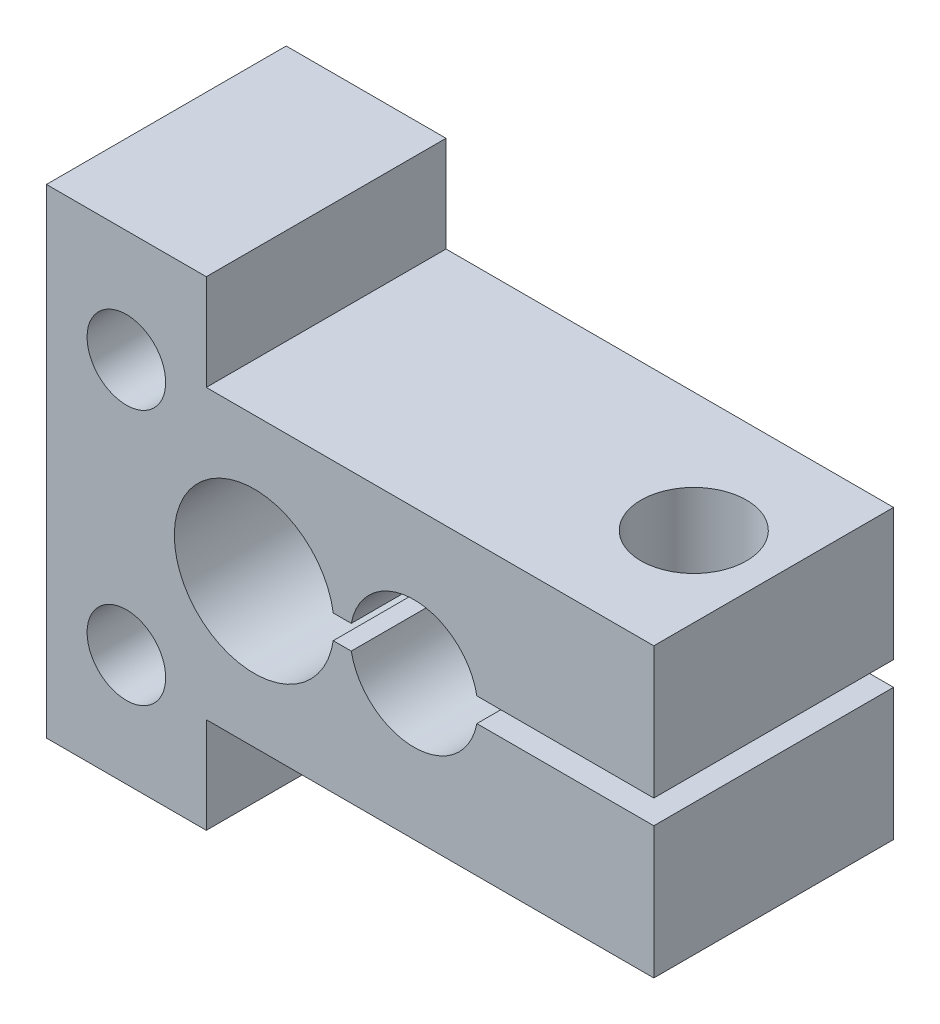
ISO-10303-21;
HEADER;
FILE_DESCRIPTION(('STEP AP214'),'2;1');
FILE_NAME('part.step','',(''),(''),'','','');
FILE_SCHEMA(('AUTOMOTIVE_DESIGN { 1 0 10303 214 1 1 1 1 }'));
ENDSEC;
DATA;
#1=APPLICATION_CONTEXT('core data for automotive mechanical design processes');
#2=APPLICATION_PROTOCOL_DEFINITION('international standard','automotive_design',2000,#1);
#3=PRODUCT_CONTEXT('',#1,'mechanical');
#4=PRODUCT('Part','Part','',(#3));
#5=PRODUCT_RELATED_PRODUCT_CATEGORY('part','',(#4));
#6=PRODUCT_DEFINITION_FORMATION('','',#4);
#7=PRODUCT_DEFINITION_CONTEXT('part definition',#1,'design');
#8=PRODUCT_DEFINITION('design','',#6,#7);
#9=PRODUCT_DEFINITION_SHAPE('','',#8);
#10=(LENGTH_UNIT() NAMED_UNIT(*) SI_UNIT(.MILLI.,.METRE.));
#11=(NAMED_UNIT(*) PLANE_ANGLE_UNIT() SI_UNIT($,.RADIAN.));
#12=(NAMED_UNIT(*) SI_UNIT($,.STERADIAN.) SOLID_ANGLE_UNIT());
#13=UNCERTAINTY_MEASURE_WITH_UNIT(LENGTH_MEASURE(1.E-05),#10,'distance_accuracy_value','');
#14=(GEOMETRIC_REPRESENTATION_CONTEXT(3) GLOBAL_UNCERTAINTY_ASSIGNED_CONTEXT((#13)) GLOBAL_UNIT_ASSIGNED_CONTEXT((#10,
#11,#12)) REPRESENTATION_CONTEXT('',''));
#15=CARTESIAN_POINT('',(0.,0.,0.));
#16=DIRECTION('',(0.,0.,1.));
#17=DIRECTION('',(1.,0.,0.));
#18=AXIS2_PLACEMENT_3D('',#15,#16,#17);
#19=CARTESIAN_POINT('',(-3.,-9.,7.5));
#20=DIRECTION('',(0.,1.,0.));
#21=DIRECTION('',(0.,0.,1.));
#22=AXIS2_PLACEMENT_3D('',#19,#20,#21);
#23=PLANE('',#22);
#24=DIRECTION('',(0.,0.,-1.));
#25=VECTOR('',#24,1.);
#26=CARTESIAN_POINT('',(-3.,-9.,7.5));
#27=LINE('',#26,#25);
#28=CARTESIAN_POINT('',(-3.,-9.,7.5));
#29=VERTEX_POINT('',#28);
#30=CARTESIAN_POINT('',(-3.,-9.,-7.5));
#31=VERTEX_POINT('',#30);
#32=EDGE_CURVE('E244',#29,#31,#27,.T.);
#33=ORIENTED_EDGE('',*,*,#32,.T.);
#34=DIRECTION('',(1.,0.,0.));
#35=VECTOR('',#34,1.);
#36=CARTESIAN_POINT('',(-3.,-9.,-7.5));
#37=LINE('',#36,#35);
#38=CARTESIAN_POINT('',(25.,-9.,-7.5));
#39=VERTEX_POINT('',#38);
#40=EDGE_CURVE('E206',#31,#39,#37,.T.);
#41=ORIENTED_EDGE('',*,*,#40,.T.);
#42=DIRECTION('',(0.,0.,-1.));
#43=VECTOR('',#42,1.);
#44=CARTESIAN_POINT('',(25.,-9.,7.5));
#45=LINE('',#44,#43);
#46=CARTESIAN_POINT('',(25.,-9.,7.5));
#47=VERTEX_POINT('',#46);
#48=EDGE_CURVE('E242',#47,#39,#45,.T.);
#49=ORIENTED_EDGE('',*,*,#48,.F.);
#50=DIRECTION('',(1.,0.,0.));
#51=VECTOR('',#50,1.);
#52=CARTESIAN_POINT('',(-3.,-9.,7.5));
#53=LINE('',#52,#51);
#54=EDGE_CURVE('E227',#29,#47,#53,.T.);
#55=ORIENTED_EDGE('',*,*,#54,.F.);
#56=EDGE_LOOP('',(#33,#41,#49,#55));
#57=FACE_BOUND('',#56,.T.);
#58=CARTESIAN_POINT('',(20.,-9.,0.));
#59=DIRECTION('',(0.,1.,0.));
#60=DIRECTION('',(0.,0.,1.));
#61=AXIS2_PLACEMENT_3D('',#58,#59,#60);
#62=CIRCLE('',#61,3.);
#63=CARTESIAN_POINT('',(20.,-9.,3.));
#64=VERTEX_POINT('',#63);
#65=EDGE_CURVE('E275',#64,#64,#62,.T.);
#66=ORIENTED_EDGE('',*,*,#65,.T.);
#67=EDGE_LOOP('',(#66));
#68=FACE_BOUND('',#67,.T.);
#69=ADVANCED_FACE('F35',(#57,#68),#23,.F.);
#70=CARTESIAN_POINT('',(25.,9.,7.5));
#71=DIRECTION('',(0.,-1.,0.));
#72=DIRECTION('',(0.,0.,-1.));
#73=AXIS2_PLACEMENT_3D('',#70,#71,#72);
#74=PLANE('',#73);
#75=DIRECTION('',(0.,0.,-1.));
#76=VECTOR('',#75,1.);
#77=CARTESIAN_POINT('',(25.,9.,7.5));
#78=LINE('',#77,#76);
#79=CARTESIAN_POINT('',(25.,9.,7.5));
#80=VERTEX_POINT('',#79);
#81=CARTESIAN_POINT('',(25.,9.,-7.5));
#82=VERTEX_POINT('',#81);
#83=EDGE_CURVE('E239',#80,#82,#78,.T.);
#84=ORIENTED_EDGE('',*,*,#83,.T.);
#85=DIRECTION('',(-1.,0.,0.));
#86=VECTOR('',#85,1.);
#87=CARTESIAN_POINT('',(25.,9.,-7.5));
#88=LINE('',#87,#86);
#89=CARTESIAN_POINT('',(-3.,9.,-7.5));
#90=VERTEX_POINT('',#89);
#91=EDGE_CURVE('E213',#82,#90,#88,.T.);
#92=ORIENTED_EDGE('',*,*,#91,.T.);
#93=DIRECTION('',(0.,0.,-1.));
#94=VECTOR('',#93,1.);
#95=CARTESIAN_POINT('',(-3.,9.,7.5));
#96=LINE('',#95,#94);
#97=CARTESIAN_POINT('',(-3.,9.,7.5));
#98=VERTEX_POINT('',#97);
#99=EDGE_CURVE('E237',#98,#90,#96,.T.);
#100=ORIENTED_EDGE('',*,*,#99,.F.);
#101=DIRECTION('',(-1.,0.,0.));
#102=VECTOR('',#101,1.);
#103=CARTESIAN_POINT('',(25.,9.,7.5));
#104=LINE('',#103,#102);
#105=EDGE_CURVE('E232',#80,#98,#104,.T.);
#106=ORIENTED_EDGE('',*,*,#105,.F.);
#107=EDGE_LOOP('',(#84,#92,#100,#106));
#108=FACE_BOUND('',#107,.T.);
#109=CARTESIAN_POINT('',(20.,9.,0.));
#110=DIRECTION('',(0.,1.,0.));
#111=DIRECTION('',(0.,0.,1.));
#112=AXIS2_PLACEMENT_3D('',#109,#110,#111);
#113=CIRCLE('',#112,3.3);
#114=CARTESIAN_POINT('',(20.,9.,3.3));
#115=VERTEX_POINT('',#114);
#116=EDGE_CURVE('E263',#115,#115,#113,.T.);
#117=ORIENTED_EDGE('',*,*,#116,.F.);
#118=EDGE_LOOP('',(#117));
#119=FACE_BOUND('',#118,.T.);
#120=ADVANCED_FACE('F349',(#108,#119),#74,.F.);
#121=CARTESIAN_POINT('',(13.929058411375,-0.75,8.5));
#122=DIRECTION('',(0.,1.,0.));
#123=DIRECTION('',(0.,0.,1.));
#124=AXIS2_PLACEMENT_3D('',#121,#122,#123);
#125=PLANE('',#124);
#126=DIRECTION('',(0.,0.,-1.));
#127=VECTOR('',#126,1.);
#128=CARTESIAN_POINT('',(25.,-0.750000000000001,7.5));
#129=LINE('',#128,#127);
#130=CARTESIAN_POINT('',(25.,-0.750000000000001,7.5));
#131=VERTEX_POINT('',#130);
#132=CARTESIAN_POINT('',(25.,-0.750000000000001,-7.5));
#133=VERTEX_POINT('',#132);
#134=EDGE_CURVE('E183',#131,#133,#129,.T.);
#135=ORIENTED_EDGE('',*,*,#134,.T.);
#136=DIRECTION('',(-1.,0.,0.));
#137=VECTOR('',#136,1.);
#138=CARTESIAN_POINT('',(-13.,-0.750000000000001,-7.5));
#139=LINE('',#138,#137);
#140=CARTESIAN_POINT('',(13.929058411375,-0.75,-7.5));
#141=VERTEX_POINT('',#140);
#142=EDGE_CURVE('E12',#133,#141,#139,.T.);
#143=ORIENTED_EDGE('',*,*,#142,.T.);
#144=DIRECTION('',(0.,0.,-1.));
#145=VECTOR('',#144,1.);
#146=CARTESIAN_POINT('',(13.929058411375,-0.75,8.5));
#147=LINE('',#146,#145);
#148=CARTESIAN_POINT('',(13.929058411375,-0.75,7.5));
#149=VERTEX_POINT('',#148);
#150=EDGE_CURVE('E292',#149,#141,#147,.T.);
#151=ORIENTED_EDGE('',*,*,#150,.F.);
#152=DIRECTION('',(-1.,0.,0.));
#153=VECTOR('',#152,1.);
#154=CARTESIAN_POINT('',(-13.,-0.750000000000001,7.5));
#155=LINE('',#154,#153);
#156=EDGE_CURVE('E185',#131,#149,#155,.T.);
#157=ORIENTED_EDGE('',*,*,#156,.F.);
#158=EDGE_LOOP('',(#135,#143,#151,#157));
#159=FACE_BOUND('',#158,.T.);
#160=CARTESIAN_POINT('',(20.,-0.750000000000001,0.));
#161=DIRECTION('',(0.,1.,0.));
#162=DIRECTION('',(0.,0.,1.));
#163=AXIS2_PLACEMENT_3D('',#160,#161,#162);
#164=CIRCLE('',#163,2.4585);
#165=CARTESIAN_POINT('',(20.,-0.750000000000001,2.4585));
#166=VERTEX_POINT('',#165);
#167=EDGE_CURVE('E39',#166,#166,#164,.F.);
#168=ORIENTED_EDGE('',*,*,#167,.T.);
#169=EDGE_LOOP('',(#168));
#170=FACE_BOUND('',#169,.T.);
#171=ADVANCED_FACE('F312',(#159,#170),#125,.T.);
#172=CARTESIAN_POINT('',(26.,0.75000000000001,8.5));
#173=DIRECTION('',(0.,-1.,0.));
#174=DIRECTION('',(1.,0.,0.));
#175=AXIS2_PLACEMENT_3D('',#172,#173,#174);
#176=PLANE('',#175);
#177=DIRECTION('',(0.,0.,-1.));
#178=VECTOR('',#177,1.);
#179=CARTESIAN_POINT('',(13.929058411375,0.75,8.5));
#180=LINE('',#179,#178);
#181=CARTESIAN_POINT('',(13.929058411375,0.75,7.5));
#182=VERTEX_POINT('',#181);
#183=CARTESIAN_POINT('',(13.929058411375,0.75,-7.5));
#184=VERTEX_POINT('',#183);
#185=EDGE_CURVE('E157',#182,#184,#180,.T.);
#186=ORIENTED_EDGE('',*,*,#185,.T.);
#187=DIRECTION('',(1.,0.,0.));
#188=VECTOR('',#187,1.);
#189=CARTESIAN_POINT('',(-13.,0.749999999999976,-7.5));
#190=LINE('',#189,#188);
#191=CARTESIAN_POINT('',(25.,0.750000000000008,-7.5));
#192=VERTEX_POINT('',#191);
#193=EDGE_CURVE('E255',#184,#192,#190,.T.);
#194=ORIENTED_EDGE('',*,*,#193,.T.);
#195=DIRECTION('',(0.,0.,1.));
#196=VECTOR('',#195,1.);
#197=CARTESIAN_POINT('',(25.,0.750000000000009,7.5));
#198=LINE('',#197,#196);
#199=CARTESIAN_POINT('',(25.,0.750000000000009,7.5));
#200=VERTEX_POINT('',#199);
#201=EDGE_CURVE('E160',#192,#200,#198,.T.);
#202=ORIENTED_EDGE('',*,*,#201,.T.);
#203=DIRECTION('',(1.,0.,0.));
#204=VECTOR('',#203,1.);
#205=CARTESIAN_POINT('',(-13.,0.749999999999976,7.5));
#206=LINE('',#205,#204);
#207=EDGE_CURVE('E181',#182,#200,#206,.T.);
#208=ORIENTED_EDGE('',*,*,#207,.F.);
#209=EDGE_LOOP('',(#186,#194,#202,#208));
#210=FACE_BOUND('',#209,.T.);
#211=CARTESIAN_POINT('',(20.,0.750000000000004,0.));
#212=DIRECTION('',(0.,-1.,0.));
#213=DIRECTION('',(1.,0.,0.));
#214=AXIS2_PLACEMENT_3D('',#211,#212,#213);
#215=CIRCLE('',#214,3.3);
#216=CARTESIAN_POINT('',(23.3,0.750000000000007,0.));
#217=VERTEX_POINT('',#216);
#218=EDGE_CURVE('E261',#217,#217,#215,.F.);
#219=ORIENTED_EDGE('',*,*,#218,.T.);
#220=EDGE_LOOP('',(#219));
#221=FACE_BOUND('',#220,.T.);
#222=ADVANCED_FACE('F359',(#210,#221),#176,.T.);
#223=CARTESIAN_POINT('',(-13.,15.,7.5));
#224=DIRECTION('',(0.,0.,1.));
#225=DIRECTION('',(1.,0.,0.));
#226=AXIS2_PLACEMENT_3D('',#223,#224,#225);
#227=PLANE('',#226);
#228=CARTESIAN_POINT('',(-8.,8.,7.5));
#229=DIRECTION('',(0.,0.,-1.));
#230=DIRECTION('',(-1.,0.,0.));
#231=AXIS2_PLACEMENT_3D('',#228,#229,#230);
#232=CIRCLE('',#231,2.4585);
#233=CARTESIAN_POINT('',(-10.4585,8.,7.5));
#234=VERTEX_POINT('',#233);
#235=EDGE_CURVE('E284',#234,#234,#232,.T.);
#236=ORIENTED_EDGE('',*,*,#235,.T.);
#237=EDGE_LOOP('',(#236));
#238=FACE_BOUND('',#237,.T.);
#239=DIRECTION('',(0.,1.,0.));
#240=VECTOR('',#239,1.);
#241=CARTESIAN_POINT('',(25.,-9.,7.5));
#242=LINE('',#241,#240);
#243=EDGE_CURVE('E230',#47,#131,#242,.T.);
#244=ORIENTED_EDGE('',*,*,#243,.T.);
#245=ORIENTED_EDGE('',*,*,#156,.T.);
#246=CARTESIAN_POINT('',(9.9999999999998,-2.74411569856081E-13,7.5));
#247=DIRECTION('',(0.,0.,1.));
#248=DIRECTION('',(1.,0.,0.));
#249=AXIS2_PLACEMENT_3D('',#246,#247,#248);
#250=CIRCLE('',#249,3.99999999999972);
#251=CARTESIAN_POINT('',(6.0709415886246,-0.749999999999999,7.5));
#252=VERTEX_POINT('',#251);
#253=EDGE_CURVE('E188',#149,#252,#250,.F.);
#254=ORIENTED_EDGE('',*,*,#253,.T.);
#255=DIRECTION('',(-1.,0.,0.));
#256=VECTOR('',#255,1.);
#257=CARTESIAN_POINT('',(-13.,-0.750000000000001,7.5));
#258=LINE('',#257,#256);
#259=CARTESIAN_POINT('',(4.9434299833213,-0.75,7.5));
#260=VERTEX_POINT('',#259);
#261=EDGE_CURVE('E191',#252,#260,#258,.T.);
#262=ORIENTED_EDGE('',*,*,#261,.T.);
#263=CARTESIAN_POINT('',(0.,0.,7.5));
#264=DIRECTION('',(0.,0.,1.));
#265=DIRECTION('',(1.,0.,0.));
#266=AXIS2_PLACEMENT_3D('',#263,#264,#265);
#267=CIRCLE('',#266,5.);
#268=CARTESIAN_POINT('',(4.9434299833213,0.75,7.5));
#269=VERTEX_POINT('',#268);
#270=EDGE_CURVE('E172',#260,#269,#267,.F.);
#271=ORIENTED_EDGE('',*,*,#270,.T.);
#272=DIRECTION('',(1.,0.,0.));
#273=VECTOR('',#272,1.);
#274=CARTESIAN_POINT('',(-13.,0.750000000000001,7.5));
#275=LINE('',#274,#273);
#276=CARTESIAN_POINT('',(6.0709415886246,0.75,7.5));
#277=VERTEX_POINT('',#276);
#278=EDGE_CURVE('E161',#269,#277,#275,.T.);
#279=ORIENTED_EDGE('',*,*,#278,.T.);
#280=CARTESIAN_POINT('',(9.9999999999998,-2.74411569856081E-13,7.5));
#281=DIRECTION('',(0.,0.,1.));
#282=DIRECTION('',(1.,0.,0.));
#283=AXIS2_PLACEMENT_3D('',#280,#281,#282);
#284=CIRCLE('',#283,3.99999999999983);
#285=EDGE_CURVE('E151',#277,#182,#284,.F.);
#286=ORIENTED_EDGE('',*,*,#285,.T.);
#287=ORIENTED_EDGE('',*,*,#207,.T.);
#288=EDGE_CURVE('E229',#200,#80,#242,.T.);
#289=ORIENTED_EDGE('',*,*,#288,.T.);
#290=ORIENTED_EDGE('',*,*,#105,.T.);
#291=DIRECTION('',(0.,1.,0.));
#292=VECTOR('',#291,1.);
#293=CARTESIAN_POINT('',(-3.,9.,7.5));
#294=LINE('',#293,#292);
#295=CARTESIAN_POINT('',(-3.,15.,7.5));
#296=VERTEX_POINT('',#295);
#297=EDGE_CURVE('E60',#98,#296,#294,.T.);
#298=ORIENTED_EDGE('',*,*,#297,.T.);
#299=DIRECTION('',(-1.,0.,0.));
#300=VECTOR('',#299,1.);
#301=CARTESIAN_POINT('',(-3.,15.,7.5));
#302=LINE('',#301,#300);
#303=CARTESIAN_POINT('',(-13.,15.,7.5));
#304=VERTEX_POINT('',#303);
#305=EDGE_CURVE('E219',#296,#304,#302,.T.);
#306=ORIENTED_EDGE('',*,*,#305,.T.);
#307=DIRECTION('',(0.,-1.,0.));
#308=VECTOR('',#307,1.);
#309=CARTESIAN_POINT('',(-13.,15.,7.5));
#310=LINE('',#309,#308);
#311=CARTESIAN_POINT('',(-13.,-15.,7.5));
#312=VERTEX_POINT('',#311);
#313=EDGE_CURVE('E221',#304,#312,#310,.T.);
#314=ORIENTED_EDGE('',*,*,#313,.T.);
#315=DIRECTION('',(1.,0.,0.));
#316=VECTOR('',#315,1.);
#317=CARTESIAN_POINT('',(-13.,-15.,7.5));
#318=LINE('',#317,#316);
#319=CARTESIAN_POINT('',(-3.,-15.,7.5));
#320=VERTEX_POINT('',#319);
#321=EDGE_CURVE('E223',#312,#320,#318,.T.);
#322=ORIENTED_EDGE('',*,*,#321,.T.);
#323=DIRECTION('',(0.,1.,0.));
#324=VECTOR('',#323,1.);
#325=CARTESIAN_POINT('',(-3.,-15.,7.5));
#326=LINE('',#325,#324);
#327=EDGE_CURVE('E225',#320,#29,#326,.T.);
#328=ORIENTED_EDGE('',*,*,#327,.T.);
#329=ORIENTED_EDGE('',*,*,#54,.T.);
#330=EDGE_LOOP('',(#244,#245,#254,#262,#271,#279,#286,#287,#289,#290,#298,#306,#314,#322,#328,#329));
#331=FACE_BOUND('',#330,.T.);
#332=CARTESIAN_POINT('',(-8.,-8.,7.5));
#333=DIRECTION('',(0.,0.,-1.));
#334=DIRECTION('',(-1.,0.,0.));
#335=AXIS2_PLACEMENT_3D('',#332,#333,#334);
#336=CIRCLE('',#335,2.4585);
#337=CARTESIAN_POINT('',(-10.4585,-8.,7.5));
#338=VERTEX_POINT('',#337);
#339=EDGE_CURVE('E267',#338,#338,#336,.T.);
#340=ORIENTED_EDGE('',*,*,#339,.T.);
#341=EDGE_LOOP('',(#340));
#342=FACE_BOUND('',#341,.T.);
#343=ADVANCED_FACE('F169',(#238,#331,#342),#227,.T.);
#344=CARTESIAN_POINT('',(-13.,15.,-7.5));
#345=DIRECTION('',(0.,0.,1.));
#346=DIRECTION('',(1.,0.,0.));
#347=AXIS2_PLACEMENT_3D('',#344,#345,#346);
#348=PLANE('',#347);
#349=CARTESIAN_POINT('',(-8.,8.,-7.5));
#350=DIRECTION('',(0.,0.,-1.));
#351=DIRECTION('',(-1.,0.,0.));
#352=AXIS2_PLACEMENT_3D('',#349,#350,#351);
#353=CIRCLE('',#352,2.4585);
#354=CARTESIAN_POINT('',(-10.4585,8.,-7.5));
#355=VERTEX_POINT('',#354);
#356=EDGE_CURVE('E287',#355,#355,#353,.T.);
#357=ORIENTED_EDGE('',*,*,#356,.F.);
#358=EDGE_LOOP('',(#357));
#359=FACE_BOUND('',#358,.T.);
#360=ORIENTED_EDGE('',*,*,#142,.F.);
#361=DIRECTION('',(0.,1.,0.));
#362=VECTOR('',#361,1.);
#363=CARTESIAN_POINT('',(25.,-9.,-7.5));
#364=LINE('',#363,#362);
#365=EDGE_CURVE('E210',#39,#133,#364,.T.);
#366=ORIENTED_EDGE('',*,*,#365,.F.);
#367=ORIENTED_EDGE('',*,*,#40,.F.);
#368=DIRECTION('',(0.,1.,0.));
#369=VECTOR('',#368,1.);
#370=CARTESIAN_POINT('',(-3.,-15.,-7.5));
#371=LINE('',#370,#369);
#372=CARTESIAN_POINT('',(-3.,-15.,-7.5));
#373=VERTEX_POINT('',#372);
#374=EDGE_CURVE('E203',#373,#31,#371,.T.);
#375=ORIENTED_EDGE('',*,*,#374,.F.);
#376=DIRECTION('',(1.,0.,0.));
#377=VECTOR('',#376,1.);
#378=CARTESIAN_POINT('',(-13.,-15.,-7.5));
#379=LINE('',#378,#377);
#380=CARTESIAN_POINT('',(-13.,-15.,-7.5));
#381=VERTEX_POINT('',#380);
#382=EDGE_CURVE('E200',#381,#373,#379,.T.);
#383=ORIENTED_EDGE('',*,*,#382,.F.);
#384=DIRECTION('',(0.,-1.,0.));
#385=VECTOR('',#384,1.);
#386=CARTESIAN_POINT('',(-13.,15.,-7.5));
#387=LINE('',#386,#385);
#388=CARTESIAN_POINT('',(-13.,15.,-7.5));
#389=VERTEX_POINT('',#388);
#390=EDGE_CURVE('E197',#389,#381,#387,.T.);
#391=ORIENTED_EDGE('',*,*,#390,.F.);
#392=DIRECTION('',(-1.,0.,0.));
#393=VECTOR('',#392,1.);
#394=CARTESIAN_POINT('',(-3.,15.,-7.5));
#395=LINE('',#394,#393);
#396=CARTESIAN_POINT('',(-3.,15.,-7.5));
#397=VERTEX_POINT('',#396);
#398=EDGE_CURVE('E194',#397,#389,#395,.T.);
#399=ORIENTED_EDGE('',*,*,#398,.F.);
#400=DIRECTION('',(0.,1.,0.));
#401=VECTOR('',#400,1.);
#402=CARTESIAN_POINT('',(-3.,9.,-7.5));
#403=LINE('',#402,#401);
#404=EDGE_CURVE('E216',#90,#397,#403,.T.);
#405=ORIENTED_EDGE('',*,*,#404,.F.);
#406=ORIENTED_EDGE('',*,*,#91,.F.);
#407=EDGE_CURVE('E209',#192,#82,#364,.T.);
#408=ORIENTED_EDGE('',*,*,#407,.F.);
#409=ORIENTED_EDGE('',*,*,#193,.F.);
#410=CARTESIAN_POINT('',(9.9999999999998,-2.74411569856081E-13,-7.5));
#411=DIRECTION('',(0.,0.,1.));
#412=DIRECTION('',(1.,0.,0.));
#413=AXIS2_PLACEMENT_3D('',#410,#411,#412);
#414=CIRCLE('',#413,3.99999999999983);
#415=CARTESIAN_POINT('',(6.0709415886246,0.75,-7.5));
#416=VERTEX_POINT('',#415);
#417=EDGE_CURVE('E253',#416,#184,#414,.F.);
#418=ORIENTED_EDGE('',*,*,#417,.F.);
#419=DIRECTION('',(1.,0.,0.));
#420=VECTOR('',#419,1.);
#421=CARTESIAN_POINT('',(-13.,0.750000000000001,-7.5));
#422=LINE('',#421,#420);
#423=CARTESIAN_POINT('',(4.9434299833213,0.750000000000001,-7.5));
#424=VERTEX_POINT('',#423);
#425=EDGE_CURVE('E165',#424,#416,#422,.T.);
#426=ORIENTED_EDGE('',*,*,#425,.F.);
#427=CARTESIAN_POINT('',(0.,0.,-7.5));
#428=DIRECTION('',(0.,0.,1.));
#429=DIRECTION('',(1.,0.,0.));
#430=AXIS2_PLACEMENT_3D('',#427,#428,#429);
#431=CIRCLE('',#430,5.);
#432=CARTESIAN_POINT('',(4.9434299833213,-0.75,-7.5));
#433=VERTEX_POINT('',#432);
#434=EDGE_CURVE('E257',#433,#424,#431,.F.);
#435=ORIENTED_EDGE('',*,*,#434,.F.);
#436=DIRECTION('',(-1.,0.,0.));
#437=VECTOR('',#436,1.);
#438=CARTESIAN_POINT('',(-13.,-0.750000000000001,-7.5));
#439=LINE('',#438,#437);
#440=CARTESIAN_POINT('',(6.0709415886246,-0.749999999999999,-7.5));
#441=VERTEX_POINT('',#440);
#442=EDGE_CURVE('E259',#441,#433,#439,.T.);
#443=ORIENTED_EDGE('',*,*,#442,.F.);
#444=CARTESIAN_POINT('',(9.9999999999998,-2.74411569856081E-13,-7.5));
#445=DIRECTION('',(0.,0.,1.));
#446=DIRECTION('',(1.,0.,0.));
#447=AXIS2_PLACEMENT_3D('',#444,#445,#446);
#448=CIRCLE('',#447,3.99999999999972);
#449=EDGE_CURVE('E44',#141,#441,#448,.F.);
#450=ORIENTED_EDGE('',*,*,#449,.F.);
#451=EDGE_LOOP('',(#360,#366,#367,#375,#383,#391,#399,#405,#406,#408,#409,#418,#426,#435,#443,#450));
#452=FACE_BOUND('',#451,.T.);
#453=CARTESIAN_POINT('',(-8.,-8.,-7.5));
#454=DIRECTION('',(0.,0.,-1.));
#455=DIRECTION('',(-1.,0.,0.));
#456=AXIS2_PLACEMENT_3D('',#453,#454,#455);
#457=CIRCLE('',#456,2.4585);
#458=CARTESIAN_POINT('',(-10.4585,-8.,-7.5));
#459=VERTEX_POINT('',#458);
#460=EDGE_CURVE('E281',#459,#459,#457,.T.);
#461=ORIENTED_EDGE('',*,*,#460,.F.);
#462=EDGE_LOOP('',(#461));
#463=FACE_BOUND('',#462,.T.);
#464=ADVANCED_FACE('F305',(#359,#452,#463),#348,.F.);
#465=CARTESIAN_POINT('',(25.,-9.,7.5));
#466=DIRECTION('',(-1.,0.,0.));
#467=DIRECTION('',(0.,0.,1.));
#468=AXIS2_PLACEMENT_3D('',#465,#466,#467);
#469=PLANE('',#468);
#470=ORIENTED_EDGE('',*,*,#134,.F.);
#471=ORIENTED_EDGE('',*,*,#243,.F.);
#472=ORIENTED_EDGE('',*,*,#48,.T.);
#473=ORIENTED_EDGE('',*,*,#365,.T.);
#474=EDGE_LOOP('',(#470,#471,#472,#473));
#475=FACE_BOUND('',#474,.T.);
#476=ADVANCED_FACE('F318',(#475),#469,.F.);
#477=ORIENTED_EDGE('',*,*,#201,.F.);
#478=ORIENTED_EDGE('',*,*,#407,.T.);
#479=ORIENTED_EDGE('',*,*,#83,.F.);
#480=ORIENTED_EDGE('',*,*,#288,.F.);
#481=EDGE_LOOP('',(#477,#478,#479,#480));
#482=FACE_BOUND('',#481,.T.);
#483=ADVANCED_FACE('F356',(#482),#469,.F.);
#484=CARTESIAN_POINT('',(-3.,15.,7.5));
#485=DIRECTION('',(0.,-1.,0.));
#486=DIRECTION('',(0.,0.,-1.));
#487=AXIS2_PLACEMENT_3D('',#484,#485,#486);
#488=PLANE('',#487);
#489=DIRECTION('',(0.,0.,-1.));
#490=VECTOR('',#489,1.);
#491=CARTESIAN_POINT('',(-3.,15.,7.5));
#492=LINE('',#491,#490);
#493=EDGE_CURVE('E235',#296,#397,#492,.T.);
#494=ORIENTED_EDGE('',*,*,#493,.T.);
#495=ORIENTED_EDGE('',*,*,#398,.T.);
#496=DIRECTION('',(0.,0.,-1.));
#497=VECTOR('',#496,1.);
#498=CARTESIAN_POINT('',(-13.,15.,7.5));
#499=LINE('',#498,#497);
#500=EDGE_CURVE('E250',#304,#389,#499,.T.);
#501=ORIENTED_EDGE('',*,*,#500,.F.);
#502=ORIENTED_EDGE('',*,*,#305,.F.);
#503=EDGE_LOOP('',(#494,#495,#501,#502));
#504=FACE_BOUND('',#503,.T.);
#505=ADVANCED_FACE('F37',(#504),#488,.F.);
#506=CARTESIAN_POINT('',(-13.,15.,7.5));
#507=DIRECTION('',(1.,0.,0.));
#508=DIRECTION('',(0.,0.,-1.));
#509=AXIS2_PLACEMENT_3D('',#506,#507,#508);
#510=PLANE('',#509);
#511=ORIENTED_EDGE('',*,*,#500,.T.);
#512=ORIENTED_EDGE('',*,*,#390,.T.);
#513=DIRECTION('',(0.,0.,-1.));
#514=VECTOR('',#513,1.);
#515=CARTESIAN_POINT('',(-13.,-15.,7.5));
#516=LINE('',#515,#514);
#517=EDGE_CURVE('E248',#312,#381,#516,.T.);
#518=ORIENTED_EDGE('',*,*,#517,.F.);
#519=ORIENTED_EDGE('',*,*,#313,.F.);
#520=EDGE_LOOP('',(#511,#512,#518,#519));
#521=FACE_BOUND('',#520,.T.);
#522=ADVANCED_FACE('F338',(#521),#510,.F.);
#523=CARTESIAN_POINT('',(-13.,-15.,7.5));
#524=DIRECTION('',(0.,1.,0.));
#525=DIRECTION('',(0.,0.,1.));
#526=AXIS2_PLACEMENT_3D('',#523,#524,#525);
#527=PLANE('',#526);
#528=ORIENTED_EDGE('',*,*,#517,.T.);
#529=ORIENTED_EDGE('',*,*,#382,.T.);
#530=DIRECTION('',(0.,0.,-1.));
#531=VECTOR('',#530,1.);
#532=CARTESIAN_POINT('',(-3.,-15.,7.5));
#533=LINE('',#532,#531);
#534=EDGE_CURVE('E246',#320,#373,#533,.T.);
#535=ORIENTED_EDGE('',*,*,#534,.F.);
#536=ORIENTED_EDGE('',*,*,#321,.F.);
#537=EDGE_LOOP('',(#528,#529,#535,#536));
#538=FACE_BOUND('',#537,.T.);
#539=ADVANCED_FACE('F333',(#538),#527,.F.);
#540=CARTESIAN_POINT('',(-3.,-15.,7.5));
#541=DIRECTION('',(-1.,0.,0.));
#542=DIRECTION('',(0.,0.,1.));
#543=AXIS2_PLACEMENT_3D('',#540,#541,#542);
#544=PLANE('',#543);
#545=ORIENTED_EDGE('',*,*,#534,.T.);
#546=ORIENTED_EDGE('',*,*,#374,.T.);
#547=ORIENTED_EDGE('',*,*,#32,.F.);
#548=ORIENTED_EDGE('',*,*,#327,.F.);
#549=EDGE_LOOP('',(#545,#546,#547,#548));
#550=FACE_BOUND('',#549,.T.);
#551=ADVANCED_FACE('F328',(#550),#544,.F.);
#552=CARTESIAN_POINT('',(-3.,9.,7.5));
#553=DIRECTION('',(-1.,0.,0.));
#554=DIRECTION('',(0.,0.,1.));
#555=AXIS2_PLACEMENT_3D('',#552,#553,#554);
#556=PLANE('',#555);
#557=ORIENTED_EDGE('',*,*,#99,.T.);
#558=ORIENTED_EDGE('',*,*,#404,.T.);
#559=ORIENTED_EDGE('',*,*,#493,.F.);
#560=ORIENTED_EDGE('',*,*,#297,.F.);
#561=EDGE_LOOP('',(#557,#558,#559,#560));
#562=FACE_BOUND('',#561,.T.);
#563=ADVANCED_FACE('F345',(#562),#556,.F.);
#564=CARTESIAN_POINT('',(0.,0.,8.5));
#565=DIRECTION('',(0.,0.,-1.));
#566=DIRECTION('',(-1.,0.,0.));
#567=AXIS2_PLACEMENT_3D('',#564,#565,#566);
#568=CYLINDRICAL_SURFACE('',#567,5.);
#569=DIRECTION('',(0.,0.,-1.));
#570=VECTOR('',#569,1.);
#571=CARTESIAN_POINT('',(4.9434299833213,-0.75,8.5));
#572=LINE('',#571,#570);
#573=EDGE_CURVE('E173',#260,#433,#572,.T.);
#574=ORIENTED_EDGE('',*,*,#573,.T.);
#575=ORIENTED_EDGE('',*,*,#434,.T.);
#576=DIRECTION('',(0.,0.,-1.));
#577=VECTOR('',#576,1.);
#578=CARTESIAN_POINT('',(4.9434299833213,0.75,8.5));
#579=LINE('',#578,#577);
#580=EDGE_CURVE('E52',#269,#424,#579,.T.);
#581=ORIENTED_EDGE('',*,*,#580,.F.);
#582=ORIENTED_EDGE('',*,*,#270,.F.);
#583=EDGE_LOOP('',(#574,#575,#581,#582));
#584=FACE_BOUND('',#583,.T.);
#585=ADVANCED_FACE('F308',(#584),#568,.F.);
#586=CARTESIAN_POINT('',(4.9434299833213,-0.75,8.5));
#587=DIRECTION('',(0.,1.,0.));
#588=DIRECTION('',(0.,0.,1.));
#589=AXIS2_PLACEMENT_3D('',#586,#587,#588);
#590=PLANE('',#589);
#591=DIRECTION('',(0.,0.,-1.));
#592=VECTOR('',#591,1.);
#593=CARTESIAN_POINT('',(6.0709415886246,-0.749999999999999,8.5));
#594=LINE('',#593,#592);
#595=EDGE_CURVE('E176',#252,#441,#594,.T.);
#596=ORIENTED_EDGE('',*,*,#595,.T.);
#597=ORIENTED_EDGE('',*,*,#442,.T.);
#598=ORIENTED_EDGE('',*,*,#573,.F.);
#599=ORIENTED_EDGE('',*,*,#261,.F.);
#600=EDGE_LOOP('',(#596,#597,#598,#599));
#601=FACE_BOUND('',#600,.T.);
#602=ADVANCED_FACE('F298',(#601),#590,.T.);
#603=CARTESIAN_POINT('',(9.9999999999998,-2.74411569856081E-13,8.5));
#604=DIRECTION('',(0.,0.,-1.));
#605=DIRECTION('',(-1.,0.,0.));
#606=AXIS2_PLACEMENT_3D('',#603,#604,#605);
#607=CYLINDRICAL_SURFACE('',#606,3.99999999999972);
#608=ORIENTED_EDGE('',*,*,#150,.T.);
#609=ORIENTED_EDGE('',*,*,#449,.T.);
#610=ORIENTED_EDGE('',*,*,#595,.F.);
#611=ORIENTED_EDGE('',*,*,#253,.F.);
#612=EDGE_LOOP('',(#608,#609,#610,#611));
#613=FACE_BOUND('',#612,.T.);
#614=ADVANCED_FACE('F310',(#613),#607,.F.);
#615=CARTESIAN_POINT('',(9.9999999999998,-2.74411569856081E-13,8.5));
#616=DIRECTION('',(0.,0.,-1.));
#617=DIRECTION('',(-1.,0.,0.));
#618=AXIS2_PLACEMENT_3D('',#615,#616,#617);
#619=CYLINDRICAL_SURFACE('',#618,3.99999999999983);
#620=DIRECTION('',(0.,0.,-1.));
#621=VECTOR('',#620,1.);
#622=CARTESIAN_POINT('',(6.0709415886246,0.75,8.5));
#623=LINE('',#622,#621);
#624=EDGE_CURVE('E154',#277,#416,#623,.T.);
#625=ORIENTED_EDGE('',*,*,#624,.T.);
#626=ORIENTED_EDGE('',*,*,#417,.T.);
#627=ORIENTED_EDGE('',*,*,#185,.F.);
#628=ORIENTED_EDGE('',*,*,#285,.F.);
#629=EDGE_LOOP('',(#625,#626,#627,#628));
#630=FACE_BOUND('',#629,.T.);
#631=ADVANCED_FACE('F153',(#630),#619,.F.);
#632=CARTESIAN_POINT('',(6.0709415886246,0.75,8.5));
#633=DIRECTION('',(0.,-1.,0.));
#634=DIRECTION('',(0.,0.,-1.));
#635=AXIS2_PLACEMENT_3D('',#632,#633,#634);
#636=PLANE('',#635);
#637=ORIENTED_EDGE('',*,*,#580,.T.);
#638=ORIENTED_EDGE('',*,*,#425,.T.);
#639=ORIENTED_EDGE('',*,*,#624,.F.);
#640=ORIENTED_EDGE('',*,*,#278,.F.);
#641=EDGE_LOOP('',(#637,#638,#639,#640));
#642=FACE_BOUND('',#641,.T.);
#643=ADVANCED_FACE('F163',(#642),#636,.T.);
#644=CARTESIAN_POINT('',(-8.,8.,7.5));
#645=DIRECTION('',(0.,0.,-1.));
#646=DIRECTION('',(-1.,0.,0.));
#647=AXIS2_PLACEMENT_3D('',#644,#645,#646);
#648=CYLINDRICAL_SURFACE('',#647,2.4585);
#649=ORIENTED_EDGE('',*,*,#356,.T.);
#650=EDGE_LOOP('',(#649));
#651=FACE_BOUND('',#650,.T.);
#652=ORIENTED_EDGE('',*,*,#235,.F.);
#653=EDGE_LOOP('',(#652));
#654=FACE_BOUND('',#653,.T.);
#655=ADVANCED_FACE('F419',(#651,#654),#648,.F.);
#656=CARTESIAN_POINT('',(-8.,-8.,7.5));
#657=DIRECTION('',(0.,0.,-1.));
#658=DIRECTION('',(-1.,0.,0.));
#659=AXIS2_PLACEMENT_3D('',#656,#657,#658);
#660=CYLINDRICAL_SURFACE('',#659,2.4585);
#661=ORIENTED_EDGE('',*,*,#460,.T.);
#662=EDGE_LOOP('',(#661));
#663=FACE_BOUND('',#662,.T.);
#664=ORIENTED_EDGE('',*,*,#339,.F.);
#665=EDGE_LOOP('',(#664));
#666=FACE_BOUND('',#665,.T.);
#667=ADVANCED_FACE('F424',(#663,#666),#660,.F.);
#668=CARTESIAN_POINT('',(20.,-9.,0.));
#669=DIRECTION('',(0.,1.,0.));
#670=DIRECTION('',(0.,0.,1.));
#671=AXIS2_PLACEMENT_3D('',#668,#669,#670);
#672=CYLINDRICAL_SURFACE('',#671,3.3);
#673=ORIENTED_EDGE('',*,*,#218,.F.);
#674=EDGE_LOOP('',(#673));
#675=FACE_BOUND('',#674,.T.);
#676=ORIENTED_EDGE('',*,*,#116,.T.);
#677=EDGE_LOOP('',(#676));
#678=FACE_BOUND('',#677,.T.);
#679=ADVANCED_FACE('F428',(#675,#678),#672,.F.);
#680=CARTESIAN_POINT('',(20.,-9.,0.));
#681=DIRECTION('',(0.,1.,0.));
#682=DIRECTION('',(0.,0.,1.));
#683=AXIS2_PLACEMENT_3D('',#680,#681,#682);
#684=CYLINDRICAL_SURFACE('',#683,2.4585);
#685=ORIENTED_EDGE('',*,*,#167,.F.);
#686=EDGE_LOOP('',(#685));
#687=FACE_BOUND('',#686,.T.);
#688=CARTESIAN_POINT('',(20.,-8.4585,0.));
#689=DIRECTION('',(0.,1.,0.));
#690=DIRECTION('',(0.,0.,1.));
#691=AXIS2_PLACEMENT_3D('',#688,#689,#690);
#692=CIRCLE('',#691,2.4585);
#693=CARTESIAN_POINT('',(20.,-8.4585,2.4585));
#694=VERTEX_POINT('',#693);
#695=EDGE_CURVE('E269',#694,#694,#692,.T.);
#696=ORIENTED_EDGE('',*,*,#695,.F.);
#697=EDGE_LOOP('',(#696));
#698=FACE_BOUND('',#697,.T.);
#699=ADVANCED_FACE('F432',(#687,#698),#684,.F.);
#700=CARTESIAN_POINT('',(20.,-9.,0.));
#701=DIRECTION('',(0.,-1.,0.));
#702=DIRECTION('',(0.,0.,-1.));
#703=AXIS2_PLACEMENT_3D('',#700,#701,#702);
#704=CONICAL_SURFACE('',#703,3.,0.78539816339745);
#705=ORIENTED_EDGE('',*,*,#695,.T.);
#706=EDGE_LOOP('',(#705));
#707=FACE_BOUND('',#706,.T.);
#708=ORIENTED_EDGE('',*,*,#65,.F.);
#709=EDGE_LOOP('',(#708));
#710=FACE_BOUND('',#709,.T.);
#711=ADVANCED_FACE('F436',(#707,#710),#704,.F.);
#712=CLOSED_SHELL('',(#69,#120,#171,#222,#343,#464,#476,#483,#505,#522,#539,#551,#563,#585,#602,
#614,#631,#643,#655,#667,#679,#699,#711));
#713=MANIFOLD_SOLID_BREP('B2',#712);
#714=ADVANCED_BREP_SHAPE_REPRESENTATION('',(#18,#713),#14);
#715=SHAPE_DEFINITION_REPRESENTATION(#9,#714);
ENDSEC;
END-ISO-10303-21;
